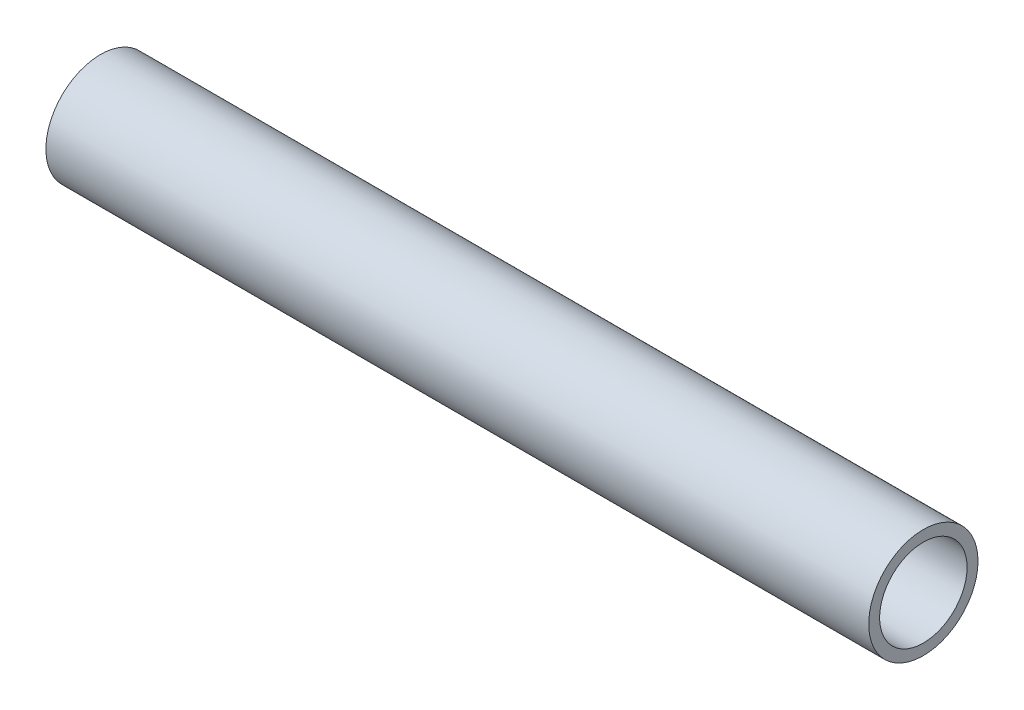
from build123d import *

# Parameters (mm, degrees)
SKETCH1_R           = 15.875
SKETCH1_R_2         = 12.7
BOSS_EXTRUDE1_DEPTH = 119.507


with BuildPart() as part:
    # Sketch1 → Boss-Extrude1 (new, symmetric)
    with BuildSketch(Plane(origin=(0, 0, 0), x_dir=(0, 0, -1), z_dir=(1, 0, 0))):
        Circle(SKETCH1_R)
        Circle(SKETCH1_R_2, mode=Mode.SUBTRACT)
    extrude(amount=BOSS_EXTRUDE1_DEPTH, both=True)


solid = part.part
